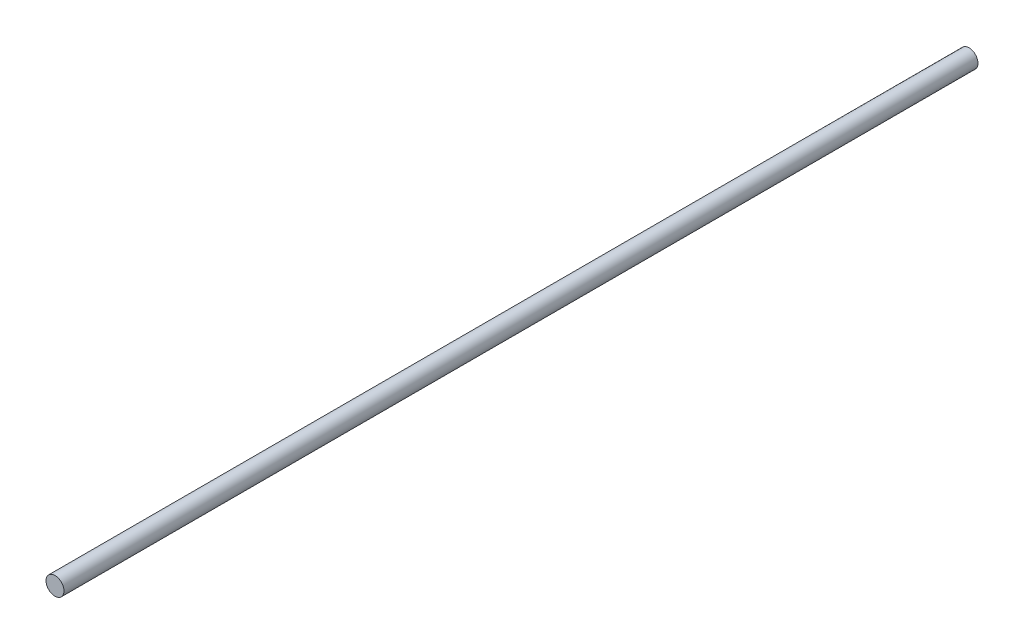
from build123d import *

# Parameters (mm, degrees)
SKETCH1_R           = 30
BOSS_EXTRUDE1_DEPTH = 3050


with BuildPart() as part:
    # Sketch1 → Boss-Extrude1 (new body)
    with BuildSketch(Plane.XY):
        Circle(SKETCH1_R)
    extrude(amount=-BOSS_EXTRUDE1_DEPTH)


solid = part.part
